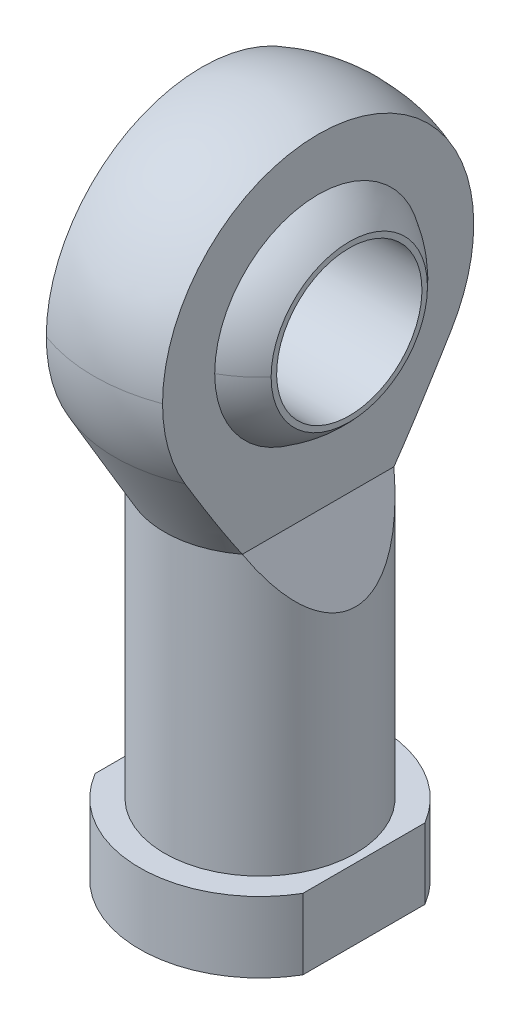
ISO-10303-21;
HEADER;
FILE_DESCRIPTION(('STEP AP214'),'2;1');
FILE_NAME('part.step','',(''),(''),'','','');
FILE_SCHEMA(('AUTOMOTIVE_DESIGN { 1 0 10303 214 1 1 1 1 }'));
ENDSEC;
DATA;
#1=APPLICATION_CONTEXT('core data for automotive mechanical design processes');
#2=APPLICATION_PROTOCOL_DEFINITION('international standard','automotive_design',2000,#1);
#3=PRODUCT_CONTEXT('',#1,'mechanical');
#4=PRODUCT('Part','Part','',(#3));
#5=PRODUCT_RELATED_PRODUCT_CATEGORY('part','',(#4));
#6=PRODUCT_DEFINITION_FORMATION('','',#4);
#7=PRODUCT_DEFINITION_CONTEXT('part definition',#1,'design');
#8=PRODUCT_DEFINITION('design','',#6,#7);
#9=PRODUCT_DEFINITION_SHAPE('','',#8);
#10=(LENGTH_UNIT() NAMED_UNIT(*) SI_UNIT(.MILLI.,.METRE.));
#11=(NAMED_UNIT(*) PLANE_ANGLE_UNIT() SI_UNIT($,.RADIAN.));
#12=(NAMED_UNIT(*) SI_UNIT($,.STERADIAN.) SOLID_ANGLE_UNIT());
#13=UNCERTAINTY_MEASURE_WITH_UNIT(LENGTH_MEASURE(1.E-05),#10,'distance_accuracy_value','');
#14=(GEOMETRIC_REPRESENTATION_CONTEXT(3) GLOBAL_UNCERTAINTY_ASSIGNED_CONTEXT((#13)) GLOBAL_UNIT_ASSIGNED_CONTEXT((#10,
#11,#12)) REPRESENTATION_CONTEXT('',''));
#15=CARTESIAN_POINT('',(0.,0.,0.));
#16=DIRECTION('',(0.,0.,1.));
#17=DIRECTION('',(1.,0.,0.));
#18=AXIS2_PLACEMENT_3D('',#15,#16,#17);
#19=CARTESIAN_POINT('',(-21.5,84.,80.));
#20=DIRECTION('',(-1.,0.,0.));
#21=DIRECTION('',(0.,-1.,0.));
#22=AXIS2_PLACEMENT_3D('',#19,#20,#21);
#23=PLANE('',#22);
#24=CARTESIAN_POINT('',(-21.5,125.,0.));
#25=DIRECTION('',(1.,0.,0.));
#26=DIRECTION('',(0.,1.,0.));
#27=AXIS2_PLACEMENT_3D('',#24,#25,#26);
#28=CIRCLE('',#27,17.5);
#29=CARTESIAN_POINT('',(-21.5,142.5,0.));
#30=VERTEX_POINT('',#29);
#31=EDGE_CURVE('E437',#30,#30,#28,.T.);
#32=ORIENTED_EDGE('',*,*,#31,.T.);
#33=EDGE_LOOP('',(#32));
#34=FACE_BOUND('',#33,.T.);
#35=CARTESIAN_POINT('',(-21.5,125.,0.));
#36=DIRECTION('',(1.,0.,0.));
#37=DIRECTION('',(0.,1.,0.));
#38=AXIS2_PLACEMENT_3D('',#35,#36,#37);
#39=CIRCLE('',#38,18.8223437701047);
#40=CARTESIAN_POINT('',(-21.5,125.,18.8223437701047));
#41=VERTEX_POINT('',#40);
#42=CARTESIAN_POINT('',(-21.5,125.,-18.8223437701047));
#43=VERTEX_POINT('',#42);
#44=EDGE_CURVE('E10',#41,#43,#39,.T.);
#45=ORIENTED_EDGE('',*,*,#44,.F.);
#46=CARTESIAN_POINT('',(-21.5,125.,0.));
#47=DIRECTION('',(1.,0.,0.));
#48=DIRECTION('',(0.,1.,0.));
#49=AXIS2_PLACEMENT_3D('',#46,#47,#48);
#50=CIRCLE('',#49,18.8223437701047);
#51=EDGE_CURVE('E981',#43,#41,#50,.T.);
#52=ORIENTED_EDGE('',*,*,#51,.F.);
#53=EDGE_LOOP('',(#45,#52));
#54=FACE_BOUND('',#53,.T.);
#55=ADVANCED_FACE('F15',(#34,#54),#23,.T.);
#56=CARTESIAN_POINT('',(21.5,166.,80.));
#57=DIRECTION('',(1.,0.,0.));
#58=DIRECTION('',(0.,0.,1.));
#59=AXIS2_PLACEMENT_3D('',#56,#57,#58);
#60=PLANE('',#59);
#61=CARTESIAN_POINT('',(21.5,125.,0.));
#62=DIRECTION('',(-1.,0.,0.));
#63=DIRECTION('',(0.,1.,0.));
#64=AXIS2_PLACEMENT_3D('',#61,#62,#63);
#65=CIRCLE('',#64,17.5);
#66=CARTESIAN_POINT('',(21.5,142.5,0.));
#67=VERTEX_POINT('',#66);
#68=EDGE_CURVE('E434',#67,#67,#65,.T.);
#69=ORIENTED_EDGE('',*,*,#68,.T.);
#70=EDGE_LOOP('',(#69));
#71=FACE_BOUND('',#70,.T.);
#72=CARTESIAN_POINT('',(21.5,125.,0.));
#73=DIRECTION('',(-1.,0.,0.));
#74=DIRECTION('',(0.,1.,0.));
#75=AXIS2_PLACEMENT_3D('',#72,#73,#74);
#76=CIRCLE('',#75,18.8223437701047);
#77=CARTESIAN_POINT('',(21.5,125.,18.8223437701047));
#78=VERTEX_POINT('',#77);
#79=CARTESIAN_POINT('',(21.5,125.,-18.8223437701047));
#80=VERTEX_POINT('',#79);
#81=EDGE_CURVE('E227',#78,#80,#76,.T.);
#82=ORIENTED_EDGE('',*,*,#81,.F.);
#83=CARTESIAN_POINT('',(21.5,125.,0.));
#84=DIRECTION('',(-1.,0.,0.));
#85=DIRECTION('',(0.,1.,0.));
#86=AXIS2_PLACEMENT_3D('',#83,#84,#85);
#87=CIRCLE('',#86,18.8223437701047);
#88=EDGE_CURVE('E26',#80,#78,#87,.T.);
#89=ORIENTED_EDGE('',*,*,#88,.F.);
#90=EDGE_LOOP('',(#82,#89));
#91=FACE_BOUND('',#90,.T.);
#92=ADVANCED_FACE('F523',(#71,#91),#60,.T.);
#93=CARTESIAN_POINT('',(29.,0.,0.));
#94=DIRECTION('',(0.,1.,0.));
#95=DIRECTION('',(0.,0.,-1.));
#96=AXIS2_PLACEMENT_3D('',#93,#94,#95);
#97=PLANE('',#96);
#98=CARTESIAN_POINT('',(0.,0.,0.));
#99=DIRECTION('',(0.,-1.,0.));
#100=DIRECTION('',(1.,0.,0.));
#101=AXIS2_PLACEMENT_3D('',#98,#99,#100);
#102=CIRCLE('',#101,18.);
#103=CARTESIAN_POINT('',(18.,0.,0.));
#104=VERTEX_POINT('',#103);
#105=EDGE_CURVE('E1013',#104,#104,#102,.T.);
#106=ORIENTED_EDGE('',*,*,#105,.F.);
#107=EDGE_LOOP('',(#106));
#108=FACE_BOUND('',#107,.T.);
#109=CARTESIAN_POINT('',(0.,0.,0.));
#110=DIRECTION('',(0.,1.,0.));
#111=DIRECTION('',(-1.,0.,0.));
#112=AXIS2_PLACEMENT_3D('',#109,#110,#111);
#113=CIRCLE('',#112,29.);
#114=CARTESIAN_POINT('',(25.,0.,-14.6969384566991));
#115=VERTEX_POINT('',#114);
#116=CARTESIAN_POINT('',(-25.,0.,-14.6969384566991));
#117=VERTEX_POINT('',#116);
#118=EDGE_CURVE('E445',#115,#117,#113,.T.);
#119=ORIENTED_EDGE('',*,*,#118,.F.);
#120=DIRECTION('',(0.,0.,-1.));
#121=VECTOR('',#120,1.);
#122=CARTESIAN_POINT('',(25.,0.,80.));
#123=LINE('',#122,#121);
#124=CARTESIAN_POINT('',(25.,0.,14.6969384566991));
#125=VERTEX_POINT('',#124);
#126=EDGE_CURVE('E441',#125,#115,#123,.T.);
#127=ORIENTED_EDGE('',*,*,#126,.F.);
#128=CARTESIAN_POINT('',(0.,0.,0.));
#129=DIRECTION('',(0.,1.,0.));
#130=DIRECTION('',(-1.,0.,0.));
#131=AXIS2_PLACEMENT_3D('',#128,#129,#130);
#132=CIRCLE('',#131,29.);
#133=CARTESIAN_POINT('',(-25.,0.,14.6969384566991));
#134=VERTEX_POINT('',#133);
#135=EDGE_CURVE('E40',#134,#125,#132,.T.);
#136=ORIENTED_EDGE('',*,*,#135,.F.);
#137=DIRECTION('',(0.,0.,1.));
#138=VECTOR('',#137,1.);
#139=CARTESIAN_POINT('',(-25.,0.,80.));
#140=LINE('',#139,#138);
#141=EDGE_CURVE('E50',#117,#134,#140,.T.);
#142=ORIENTED_EDGE('',*,*,#141,.F.);
#143=EDGE_LOOP('',(#119,#127,#136,#142));
#144=FACE_BOUND('',#143,.T.);
#145=ADVANCED_FACE('F517',(#108,#144),#97,.F.);
#146=CARTESIAN_POINT('',(-14.,125.,24.9104521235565));
#147=CARTESIAN_POINT('',(-14.,75.1790957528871,24.9104521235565));
#148=CARTESIAN_POINT('',(-14.,75.1790957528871,-24.9104521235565));
#149=CARTESIAN_POINT('',(-14.,125.,-24.9104521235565));
#150=CARTESIAN_POINT('',(-16.8342365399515,125.,23.3175741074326));
#151=CARTESIAN_POINT('',(-16.8342365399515,78.364851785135,23.3175741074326));
#152=CARTESIAN_POINT('',(-16.8342365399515,78.364851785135,-23.3175741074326));
#153=CARTESIAN_POINT('',(-16.8342365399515,125.,-23.3175741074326));
#154=CARTESIAN_POINT('',(-19.3584501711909,125.,21.2685492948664));
#155=CARTESIAN_POINT('',(-19.358450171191,82.4629014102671,21.2685492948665));
#156=CARTESIAN_POINT('',(-19.358450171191,82.4629014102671,-21.2685492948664));
#157=CARTESIAN_POINT('',(-19.3584501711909,125.,-21.2685492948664));
#158=CARTESIAN_POINT('',(-21.5,125.,18.8223437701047));
#159=CARTESIAN_POINT('',(-21.5,87.3553124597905,18.8223437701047));
#160=CARTESIAN_POINT('',(-21.5,87.3553124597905,-18.8223437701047));
#161=CARTESIAN_POINT('',(-21.5,125.,-18.8223437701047));
#162=(BOUNDED_SURFACE() B_SPLINE_SURFACE(3,3,((#146,#147,#148,#149),(#150,#151,#152,#153),(#154,
#155,#156,#157),(#158,#159,#160,#161)),.UNSPECIFIED.,.F.,.F.,
.F.) B_SPLINE_SURFACE_WITH_KNOTS((4,4),(4,4),(0.,1.),(0.,1.),
.UNSPECIFIED.) GEOMETRIC_REPRESENTATION_ITEM() RATIONAL_B_SPLINE_SURFACE(((1.,0.333333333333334,
0.333333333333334,1.),(0.990407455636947,0.330135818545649,0.330135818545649,0.990407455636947),
(0.990407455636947,0.330135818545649,0.330135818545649,0.990407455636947),(1.,0.333333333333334,
0.333333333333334,1.))) REPRESENTATION_ITEM('') SURFACE());
#163=CARTESIAN_POINT('',(0.,125.,0.));
#164=DIRECTION('',(0.,1.,0.));
#165=DIRECTION('',(1.,0.,0.));
#166=AXIS2_PLACEMENT_3D('',#163,#164,#165);
#167=CIRCLE('',#166,28.575);
#168=CARTESIAN_POINT('',(-14.,125.,-24.9104521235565));
#169=VERTEX_POINT('',#168);
#170=EDGE_CURVE('E1001',#169,#43,#167,.T.);
#171=CARTESIAN_POINT('',(-14.,125.,0.));
#172=DIRECTION('',(1.,0.,0.));
#173=DIRECTION('',(0.,1.,0.));
#174=AXIS2_PLACEMENT_3D('',#171,#172,#173);
#175=CIRCLE('',#174,24.9104521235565);
#176=CARTESIAN_POINT('',(-14.,125.,24.9104521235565));
#177=VERTEX_POINT('',#176);
#178=EDGE_CURVE('E415',#177,#169,#175,.T.);
#179=CARTESIAN_POINT('',(0.,125.,0.));
#180=DIRECTION('',(0.,-1.,0.));
#181=DIRECTION('',(1.,0.,0.));
#182=AXIS2_PLACEMENT_3D('',#179,#180,#181);
#183=CIRCLE('',#182,28.575);
#184=EDGE_CURVE('E385',#177,#41,#183,.T.);
#185=ORIENTED_EDGE('',*,*,#170,.F.);
#186=ORIENTED_EDGE('',*,*,#178,.F.);
#187=ORIENTED_EDGE('',*,*,#184,.T.);
#188=ORIENTED_EDGE('',*,*,#44,.T.);
#189=EDGE_LOOP('',(#185,#186,#187,#188));
#190=FACE_BOUND('',#189,.T.);
#191=ADVANCED_FACE('F522',(#190),#162,.T.);
#192=CARTESIAN_POINT('',(21.5,125.,18.8223437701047));
#193=CARTESIAN_POINT('',(21.5,87.3553124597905,18.8223437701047));
#194=CARTESIAN_POINT('',(21.5,87.3553124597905,-18.8223437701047));
#195=CARTESIAN_POINT('',(21.5,125.,-18.8223437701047));
#196=CARTESIAN_POINT('',(19.3584501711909,125.,21.2685492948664));
#197=CARTESIAN_POINT('',(19.358450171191,82.4629014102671,21.2685492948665));
#198=CARTESIAN_POINT('',(19.358450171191,82.4629014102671,-21.2685492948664));
#199=CARTESIAN_POINT('',(19.3584501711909,125.,-21.2685492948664));
#200=CARTESIAN_POINT('',(16.8342365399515,125.,23.3175741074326));
#201=CARTESIAN_POINT('',(16.8342365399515,78.364851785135,23.3175741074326));
#202=CARTESIAN_POINT('',(16.8342365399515,78.364851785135,-23.3175741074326));
#203=CARTESIAN_POINT('',(16.8342365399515,125.,-23.3175741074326));
#204=CARTESIAN_POINT('',(14.,125.,24.9104521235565));
#205=CARTESIAN_POINT('',(14.,75.1790957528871,24.9104521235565));
#206=CARTESIAN_POINT('',(14.,75.1790957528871,-24.9104521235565));
#207=CARTESIAN_POINT('',(14.,125.,-24.9104521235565));
#208=(BOUNDED_SURFACE() B_SPLINE_SURFACE(3,3,((#192,#193,#194,#195),(#196,#197,#198,#199),(#200,
#201,#202,#203),(#204,#205,#206,#207)),.UNSPECIFIED.,.F.,.F.,
.F.) B_SPLINE_SURFACE_WITH_KNOTS((4,4),(4,4),(0.,1.),(0.,1.),
.UNSPECIFIED.) GEOMETRIC_REPRESENTATION_ITEM() RATIONAL_B_SPLINE_SURFACE(((1.,0.333333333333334,
0.333333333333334,1.),(0.990407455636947,0.330135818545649,0.330135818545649,0.990407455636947),
(0.990407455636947,0.330135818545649,0.330135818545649,0.990407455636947),(1.,0.333333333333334,
0.333333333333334,1.))) REPRESENTATION_ITEM('') SURFACE());
#209=CARTESIAN_POINT('',(0.,125.,0.));
#210=DIRECTION('',(0.,1.,0.));
#211=DIRECTION('',(1.,0.,0.));
#212=AXIS2_PLACEMENT_3D('',#209,#210,#211);
#213=CIRCLE('',#212,28.575);
#214=CARTESIAN_POINT('',(14.,125.,-24.9104521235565));
#215=VERTEX_POINT('',#214);
#216=EDGE_CURVE('E990',#80,#215,#213,.T.);
#217=CARTESIAN_POINT('',(0.,125.,0.));
#218=DIRECTION('',(0.,-1.,0.));
#219=DIRECTION('',(1.,0.,0.));
#220=AXIS2_PLACEMENT_3D('',#217,#218,#219);
#221=CIRCLE('',#220,28.575);
#222=CARTESIAN_POINT('',(14.,125.,24.9104521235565));
#223=VERTEX_POINT('',#222);
#224=EDGE_CURVE('E989',#78,#223,#221,.T.);
#225=CARTESIAN_POINT('',(14.,125.,0.));
#226=DIRECTION('',(-1.,0.,0.));
#227=DIRECTION('',(0.,1.,0.));
#228=AXIS2_PLACEMENT_3D('',#225,#226,#227);
#229=CIRCLE('',#228,24.9104521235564);
#230=EDGE_CURVE('E412',#215,#223,#229,.T.);
#231=ORIENTED_EDGE('',*,*,#216,.F.);
#232=ORIENTED_EDGE('',*,*,#88,.T.);
#233=ORIENTED_EDGE('',*,*,#224,.T.);
#234=ORIENTED_EDGE('',*,*,#230,.F.);
#235=EDGE_LOOP('',(#231,#232,#233,#234));
#236=FACE_BOUND('',#235,.T.);
#237=ADVANCED_FACE('F509',(#236),#208,.T.);
#238=CARTESIAN_POINT('',(0.,0.,0.));
#239=DIRECTION('',(0.,1.,0.));
#240=DIRECTION('',(-1.,0.,0.));
#241=AXIS2_PLACEMENT_3D('',#238,#239,#240);
#242=CYLINDRICAL_SURFACE('',#241,29.);
#243=DIRECTION('',(0.,-1.,0.));
#244=VECTOR('',#243,1.);
#245=CARTESIAN_POINT('',(25.,64.9474411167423,14.6969384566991));
#246=LINE('',#245,#244);
#247=CARTESIAN_POINT('',(25.,17.,14.6969384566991));
#248=VERTEX_POINT('',#247);
#249=EDGE_CURVE('E446',#248,#125,#246,.T.);
#250=ORIENTED_EDGE('',*,*,#249,.F.);
#251=CARTESIAN_POINT('',(0.,17.,0.));
#252=DIRECTION('',(0.,-1.,0.));
#253=DIRECTION('',(-1.,0.,0.));
#254=AXIS2_PLACEMENT_3D('',#251,#252,#253);
#255=CIRCLE('',#254,29.);
#256=CARTESIAN_POINT('',(-25.,17.,14.6969384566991));
#257=VERTEX_POINT('',#256);
#258=EDGE_CURVE('E427',#248,#257,#255,.T.);
#259=ORIENTED_EDGE('',*,*,#258,.T.);
#260=DIRECTION('',(0.,1.,0.));
#261=VECTOR('',#260,1.);
#262=CARTESIAN_POINT('',(-25.,0.,14.6969384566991));
#263=LINE('',#262,#261);
#264=EDGE_CURVE('E996',#134,#257,#263,.T.);
#265=ORIENTED_EDGE('',*,*,#264,.F.);
#266=ORIENTED_EDGE('',*,*,#135,.T.);
#267=EDGE_LOOP('',(#250,#259,#265,#266));
#268=FACE_BOUND('',#267,.T.);
#269=ADVANCED_FACE('F282',(#268),#242,.T.);
#270=CARTESIAN_POINT('',(-25.,0.,80.));
#271=DIRECTION('',(-1.,0.,0.));
#272=DIRECTION('',(0.,-1.,0.));
#273=AXIS2_PLACEMENT_3D('',#270,#271,#272);
#274=PLANE('',#273);
#275=ORIENTED_EDGE('',*,*,#264,.T.);
#276=DIRECTION('',(0.,0.,-1.));
#277=VECTOR('',#276,1.);
#278=CARTESIAN_POINT('',(-25.,17.,0.));
#279=LINE('',#278,#277);
#280=CARTESIAN_POINT('',(-25.,17.,-14.6969384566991));
#281=VERTEX_POINT('',#280);
#282=EDGE_CURVE('E397',#257,#281,#279,.T.);
#283=ORIENTED_EDGE('',*,*,#282,.T.);
#284=DIRECTION('',(0.,1.,0.));
#285=VECTOR('',#284,1.);
#286=CARTESIAN_POINT('',(-25.,0.,-14.6969384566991));
#287=LINE('',#286,#285);
#288=EDGE_CURVE('E108',#117,#281,#287,.T.);
#289=ORIENTED_EDGE('',*,*,#288,.F.);
#290=ORIENTED_EDGE('',*,*,#141,.T.);
#291=EDGE_LOOP('',(#275,#283,#289,#290));
#292=FACE_BOUND('',#291,.T.);
#293=ADVANCED_FACE('F280',(#292),#274,.T.);
#294=CARTESIAN_POINT('',(0.,0.,0.));
#295=DIRECTION('',(0.,1.,0.));
#296=DIRECTION('',(-1.,0.,0.));
#297=AXIS2_PLACEMENT_3D('',#294,#295,#296);
#298=CYLINDRICAL_SURFACE('',#297,29.);
#299=DIRECTION('',(0.,1.,0.));
#300=VECTOR('',#299,1.);
#301=CARTESIAN_POINT('',(25.,64.9474411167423,-14.6969384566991));
#302=LINE('',#301,#300);
#303=CARTESIAN_POINT('',(25.,17.,-14.6969384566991));
#304=VERTEX_POINT('',#303);
#305=EDGE_CURVE('E1006',#115,#304,#302,.T.);
#306=ORIENTED_EDGE('',*,*,#305,.F.);
#307=ORIENTED_EDGE('',*,*,#118,.T.);
#308=ORIENTED_EDGE('',*,*,#288,.T.);
#309=CARTESIAN_POINT('',(0.,17.,0.));
#310=DIRECTION('',(0.,-1.,0.));
#311=DIRECTION('',(-1.,0.,0.));
#312=AXIS2_PLACEMENT_3D('',#309,#310,#311);
#313=CIRCLE('',#312,29.);
#314=EDGE_CURVE('E394',#281,#304,#313,.T.);
#315=ORIENTED_EDGE('',*,*,#314,.T.);
#316=EDGE_LOOP('',(#306,#307,#308,#315));
#317=FACE_BOUND('',#316,.T.);
#318=ADVANCED_FACE('F487',(#317),#298,.T.);
#319=CARTESIAN_POINT('',(25.,64.9474411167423,80.));
#320=DIRECTION('',(1.,0.,0.));
#321=DIRECTION('',(0.,0.,1.));
#322=AXIS2_PLACEMENT_3D('',#319,#320,#321);
#323=PLANE('',#322);
#324=ORIENTED_EDGE('',*,*,#305,.T.);
#325=DIRECTION('',(0.,0.,1.));
#326=VECTOR('',#325,1.);
#327=CARTESIAN_POINT('',(25.,17.,0.));
#328=LINE('',#327,#326);
#329=EDGE_CURVE('E317',#304,#248,#328,.T.);
#330=ORIENTED_EDGE('',*,*,#329,.T.);
#331=ORIENTED_EDGE('',*,*,#249,.T.);
#332=ORIENTED_EDGE('',*,*,#126,.T.);
#333=EDGE_LOOP('',(#324,#330,#331,#332));
#334=FACE_BOUND('',#333,.T.);
#335=ADVANCED_FACE('F548',(#334),#323,.T.);
#336=CARTESIAN_POINT('',(-14.,84.,80.));
#337=DIRECTION('',(-1.,0.,0.));
#338=DIRECTION('',(0.,-1.,0.));
#339=AXIS2_PLACEMENT_3D('',#336,#337,#338);
#340=PLANE('',#339);
#341=ORIENTED_EDGE('',*,*,#178,.T.);
#342=CARTESIAN_POINT('',(-14.,125.,0.));
#343=DIRECTION('',(1.,0.,0.));
#344=DIRECTION('',(0.,1.,0.));
#345=AXIS2_PLACEMENT_3D('',#342,#343,#344);
#346=CIRCLE('',#345,24.9104521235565);
#347=EDGE_CURVE('E1000',#169,#177,#346,.T.);
#348=ORIENTED_EDGE('',*,*,#347,.T.);
#349=EDGE_LOOP('',(#341,#348));
#350=FACE_BOUND('',#349,.T.);
#351=CARTESIAN_POINT('',(-13.9999999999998,105.598336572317,32.0558178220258));
#352=CARTESIAN_POINT('',(-14.0000041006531,104.936056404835,31.6549662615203));
#353=CARTESIAN_POINT('',(-14.0000521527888,104.274311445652,31.2532289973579));
#354=CARTESIAN_POINT('',(-14.0001684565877,102.973211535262,30.4606843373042));
#355=CARTESIAN_POINT('',(-14.0002360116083,102.333818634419,30.0699392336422));
#356=CARTESIAN_POINT('',(-14.000330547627,101.077420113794,29.2993776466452));
#357=CARTESIAN_POINT('',(-14.0003587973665,100.46037386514,28.9196274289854));
#358=CARTESIAN_POINT('',(-14.0003584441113,99.2486731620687,28.171035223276));
#359=CARTESIAN_POINT('',(-14.0003317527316,98.6539747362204,27.8022644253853));
#360=CARTESIAN_POINT('',(-14.000235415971,97.486971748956,27.0756045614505));
#361=CARTESIAN_POINT('',(-14.0001673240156,96.9146194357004,26.7177922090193));
#362=CARTESIAN_POINT('',(-14.0000555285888,95.7923161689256,26.0130032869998));
#363=CARTESIAN_POINT('',(-14.0000110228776,95.2423128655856,25.666110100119));
#364=CARTESIAN_POINT('',(-13.9999874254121,94.0665228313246,24.9208993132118));
#365=CARTESIAN_POINT('',(-14.0000184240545,93.44096718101,24.5222168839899));
#366=CARTESIAN_POINT('',(-14.0000473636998,92.2171482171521,23.7373577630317));
#367=CARTESIAN_POINT('',(-14.000046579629,91.6187957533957,23.351320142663));
#368=CARTESIAN_POINT('',(-14.0000210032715,90.4493934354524,22.5916820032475));
#369=CARTESIAN_POINT('',(-13.9999972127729,89.8782448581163,22.2182335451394));
#370=CARTESIAN_POINT('',(-14.0000030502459,88.684772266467,21.4319616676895));
#371=CARTESIAN_POINT('',(-14.000037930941,88.0627050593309,21.018748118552));
#372=CARTESIAN_POINT('',(-14.0000682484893,86.8508682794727,20.2060851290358));
#373=CARTESIAN_POINT('',(-14.000065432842,86.2609340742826,19.8068815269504));
#374=CARTESIAN_POINT('',(-14.0000416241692,85.1134253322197,19.0220388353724));
#375=CARTESIAN_POINT('',(-14.0000215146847,84.5556627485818,18.6366745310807));
#376=CARTESIAN_POINT('',(-14.0000000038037,83.9999999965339,18.2482876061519));
#377=B_SPLINE_CURVE_WITH_KNOTS('',3,(#351,#352,#353,#354,#355,#356,#357,#358,#359,#360,#361,
#362,#363,#364,#365,#366,#367,#368,#369,#370,#371,#372,#373,#374,#375,#376),.UNSPECIFIED.,.F.,
.F.,(4,2,2,2,2,2,2,2,2,2,2,2,4),(0.,2.32242863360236,4.57043455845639,6.74404672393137,
8.84330973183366,10.8682866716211,12.8190623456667,15.0444522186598,17.1806650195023,
19.2278614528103,21.4682430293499,23.6051409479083,25.6389419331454),.UNSPECIFIED.);
#378=CARTESIAN_POINT('',(-14.,105.598336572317,32.0558178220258));
#379=VERTEX_POINT('',#378);
#380=CARTESIAN_POINT('',(-14.,84.,18.2482876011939));
#381=VERTEX_POINT('',#380);
#382=EDGE_CURVE('E202',#379,#381,#377,.T.);
#383=ORIENTED_EDGE('',*,*,#382,.F.);
#384=CARTESIAN_POINT('',(-14.,125.,0.));
#385=DIRECTION('',(1.,0.,0.));
#386=DIRECTION('',(0.,1.,0.));
#387=AXIS2_PLACEMENT_3D('',#384,#385,#386);
#388=CIRCLE('',#387,37.4699879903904);
#389=CARTESIAN_POINT('',(-14.,125.,37.4699879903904));
#390=VERTEX_POINT('',#389);
#391=EDGE_CURVE('E207',#390,#379,#388,.T.);
#392=ORIENTED_EDGE('',*,*,#391,.F.);
#393=CARTESIAN_POINT('',(-14.,125.,0.));
#394=DIRECTION('',(1.,0.,0.));
#395=DIRECTION('',(0.,1.,0.));
#396=AXIS2_PLACEMENT_3D('',#393,#394,#395);
#397=CIRCLE('',#396,37.4699879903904);
#398=CARTESIAN_POINT('',(-14.,125.,-37.4699879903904));
#399=VERTEX_POINT('',#398);
#400=EDGE_CURVE('E408',#399,#390,#397,.T.);
#401=ORIENTED_EDGE('',*,*,#400,.F.);
#402=CARTESIAN_POINT('',(-14.,125.,0.));
#403=DIRECTION('',(1.,0.,0.));
#404=DIRECTION('',(0.,1.,0.));
#405=AXIS2_PLACEMENT_3D('',#402,#403,#404);
#406=CIRCLE('',#405,37.4699879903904);
#407=CARTESIAN_POINT('',(-14.,105.598336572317,-32.0558178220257));
#408=VERTEX_POINT('',#407);
#409=EDGE_CURVE('E123',#408,#399,#406,.T.);
#410=ORIENTED_EDGE('',*,*,#409,.F.);
#411=CARTESIAN_POINT('',(-14.0000000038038,83.9999999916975,-18.2482876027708));
#412=CARTESIAN_POINT('',(-14.0000214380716,84.5556566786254,-18.6366703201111));
#413=CARTESIAN_POINT('',(-14.0000418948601,85.1134132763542,-19.0220302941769));
#414=CARTESIAN_POINT('',(-14.000066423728,86.2609160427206,-19.8068685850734));
#415=CARTESIAN_POINT('',(-14.0000696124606,86.850850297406,-20.206072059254));
#416=CARTESIAN_POINT('',(-14.0000390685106,88.0626930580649,-21.0187393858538));
#417=CARTESIAN_POINT('',(-14.0000035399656,88.6847662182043,-21.4319573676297));
#418=CARTESIAN_POINT('',(-13.9999967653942,89.8782304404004,-22.2182243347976));
#419=CARTESIAN_POINT('',(-14.0000202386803,90.4493645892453,-22.5916636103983));
#420=CARTESIAN_POINT('',(-14.0000461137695,91.6187524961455,-23.3512924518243));
#421=CARTESIAN_POINT('',(-14.000047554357,92.2171050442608,-23.7373298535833));
#422=CARTESIAN_POINT('',(-14.0000190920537,93.4409384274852,-24.5221981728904));
#423=CARTESIAN_POINT('',(-13.9999878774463,94.066508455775,-24.9208899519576));
#424=CARTESIAN_POINT('',(-14.0000106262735,95.2423073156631,-25.666106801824));
#425=CARTESIAN_POINT('',(-14.0000545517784,95.7923050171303,-26.0129967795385));
#426=CARTESIAN_POINT('',(-14.000165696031,96.9145993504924,-26.7177804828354));
#427=CARTESIAN_POINT('',(-14.000233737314,97.4869483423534,-27.0755908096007));
#428=CARTESIAN_POINT('',(-14.0003301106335,98.6539468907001,-27.8022479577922));
#429=CARTESIAN_POINT('',(-14.0003568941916,99.2486442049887,-28.1710180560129));
#430=CARTESIAN_POINT('',(-14.0003575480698,100.460344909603,-28.9196101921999));
#431=CARTESIAN_POINT('',(-14.0003295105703,101.077392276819,-29.2993610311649));
#432=CARTESIAN_POINT('',(-14.0002353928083,102.33379525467,-30.0699252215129));
#433=CARTESIAN_POINT('',(-14.000168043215,102.973191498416,-30.4606723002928));
#434=CARTESIAN_POINT('',(-14.0000520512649,104.274300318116,-31.2532222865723));
#435=CARTESIAN_POINT('',(-14.0000041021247,104.936050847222,-31.6549628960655));
#436=CARTESIAN_POINT('',(-14.,105.598336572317,-32.0558178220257));
#437=B_SPLINE_CURVE_WITH_KNOTS('',3,(#411,#412,#413,#414,#415,#416,#417,#418,#419,#420,#421,
#422,#423,#424,#425,#426,#427,#428,#429,#430,#431,#432,#433,#434,#435,#436),.UNSPECIFIED.,.F.,
.F.,(4,2,2,2,2,2,2,2,2,2,2,2,4),(0.,2.03377883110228,4.17067665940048,6.41108047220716,
8.45822559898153,10.5944382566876,12.8198795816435,14.7706359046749,16.7956011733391,
18.8948602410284,21.0684762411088,23.3164938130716,25.63894193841),.UNSPECIFIED.);
#438=CARTESIAN_POINT('',(-14.,83.9999999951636,-18.2482875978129));
#439=VERTEX_POINT('',#438);
#440=EDGE_CURVE('E387',#439,#408,#437,.T.);
#441=ORIENTED_EDGE('',*,*,#440,.F.);
#442=DIRECTION('',(0.,0.,-1.));
#443=VECTOR('',#442,1.);
#444=CARTESIAN_POINT('',(-14.,84.,80.));
#445=LINE('',#444,#443);
#446=EDGE_CURVE('E209',#381,#439,#445,.T.);
#447=ORIENTED_EDGE('',*,*,#446,.F.);
#448=EDGE_LOOP('',(#383,#392,#401,#410,#441,#447));
#449=FACE_BOUND('',#448,.T.);
#450=ADVANCED_FACE('F205',(#350,#449),#340,.T.);
#451=CARTESIAN_POINT('',(14.,166.,80.));
#452=DIRECTION('',(1.,0.,0.));
#453=DIRECTION('',(0.,0.,1.));
#454=AXIS2_PLACEMENT_3D('',#451,#452,#453);
#455=PLANE('',#454);
#456=CARTESIAN_POINT('',(14.,125.,0.));
#457=DIRECTION('',(-1.,0.,0.));
#458=DIRECTION('',(0.,1.,0.));
#459=AXIS2_PLACEMENT_3D('',#456,#457,#458);
#460=CIRCLE('',#459,24.9104521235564);
#461=EDGE_CURVE('E985',#223,#215,#460,.T.);
#462=ORIENTED_EDGE('',*,*,#461,.T.);
#463=ORIENTED_EDGE('',*,*,#230,.T.);
#464=EDGE_LOOP('',(#462,#463));
#465=FACE_BOUND('',#464,.T.);
#466=CARTESIAN_POINT('',(14.,105.598336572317,-32.0558178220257));
#467=CARTESIAN_POINT('',(14.0000041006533,104.936056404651,-31.654966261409));
#468=CARTESIAN_POINT('',(14.0000521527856,104.274311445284,-31.2532289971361));
#469=CARTESIAN_POINT('',(14.0001684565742,102.9732115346,-30.4606843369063));
#470=CARTESIAN_POINT('',(14.000236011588,102.333818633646,-30.069939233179));
#471=CARTESIAN_POINT('',(14.0003305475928,101.077420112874,-29.299377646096));
#472=CARTESIAN_POINT('',(14.0003587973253,100.460373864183,-28.9196274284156));
#473=CARTESIAN_POINT('',(14.0003584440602,99.2486731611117,-28.1710352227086));
#474=CARTESIAN_POINT('',(14.0003317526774,98.6539747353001,-27.8022644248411));
#475=CARTESIAN_POINT('',(14.0002354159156,97.4869717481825,-27.075604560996));
#476=CARTESIAN_POINT('',(14.0001673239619,96.9146194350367,-26.7177922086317));
#477=CARTESIAN_POINT('',(14.0000555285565,95.7923161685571,-26.0130032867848));
#478=CARTESIAN_POINT('',(14.0000110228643,95.2423128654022,-25.6661101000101));
#479=CARTESIAN_POINT('',(13.9999874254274,94.0665228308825,-24.9208993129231));
#480=CARTESIAN_POINT('',(14.0000184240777,93.4409671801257,-24.5222168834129));
#481=CARTESIAN_POINT('',(14.0000473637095,92.2171482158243,-23.737357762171));
#482=CARTESIAN_POINT('',(14.0000465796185,91.6187957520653,-23.351320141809));
#483=CARTESIAN_POINT('',(14.0000210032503,90.4493934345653,-22.5916820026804));
#484=CARTESIAN_POINT('',(13.9999972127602,89.878244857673,-22.2182335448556));
#485=CARTESIAN_POINT('',(14.0000030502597,88.6847722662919,-21.4319616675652));
#486=CARTESIAN_POINT('',(14.0000379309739,88.0627050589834,-21.0187481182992));
#487=CARTESIAN_POINT('',(14.000068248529,86.8508682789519,-20.2060851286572));
#488=CARTESIAN_POINT('',(14.0000654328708,86.2609340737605,-19.8068815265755));
#489=CARTESIAN_POINT('',(14.0000416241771,85.1134253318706,-19.022038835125));
#490=CARTESIAN_POINT('',(14.0000215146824,84.5556627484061,-18.6366745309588));
#491=CARTESIAN_POINT('',(14.0000000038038,83.9999999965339,-18.2482876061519));
#492=B_SPLINE_CURVE_WITH_KNOTS('',3,(#466,#467,#468,#469,#470,#471,#472,#473,#474,#475,#476,
#477,#478,#479,#480,#481,#482,#483,#484,#485,#486,#487,#488,#489,#490,#491),.UNSPECIFIED.,.F.,
.F.,(4,2,2,2,2,2,2,2,2,2,2,2,4),(0.,2.32242863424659,4.57043455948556,6.74404672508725,
8.84330973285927,10.8682866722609,12.8190623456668,15.0444522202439,17.1806650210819,
19.2278614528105,21.4682430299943,23.60514094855,25.6389419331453),.UNSPECIFIED.);
#493=CARTESIAN_POINT('',(14.,105.598336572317,-32.0558178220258));
#494=VERTEX_POINT('',#493);
#495=CARTESIAN_POINT('',(14.,84.,-18.248287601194));
#496=VERTEX_POINT('',#495);
#497=EDGE_CURVE('E310',#494,#496,#492,.T.);
#498=ORIENTED_EDGE('',*,*,#497,.F.);
#499=CARTESIAN_POINT('',(14.,125.,0.));
#500=DIRECTION('',(-1.,0.,0.));
#501=DIRECTION('',(0.,1.,0.));
#502=AXIS2_PLACEMENT_3D('',#499,#500,#501);
#503=CIRCLE('',#502,37.4699879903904);
#504=CARTESIAN_POINT('',(14.,125.,-37.4699879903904));
#505=VERTEX_POINT('',#504);
#506=EDGE_CURVE('E314',#505,#494,#503,.T.);
#507=ORIENTED_EDGE('',*,*,#506,.F.);
#508=CARTESIAN_POINT('',(14.,125.,0.));
#509=DIRECTION('',(-1.,0.,0.));
#510=DIRECTION('',(0.,1.,0.));
#511=AXIS2_PLACEMENT_3D('',#508,#509,#510);
#512=CIRCLE('',#511,37.4699879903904);
#513=CARTESIAN_POINT('',(14.,125.,37.4699879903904));
#514=VERTEX_POINT('',#513);
#515=EDGE_CURVE('E419',#514,#505,#512,.T.);
#516=ORIENTED_EDGE('',*,*,#515,.F.);
#517=CARTESIAN_POINT('',(14.,125.,0.));
#518=DIRECTION('',(-1.,0.,0.));
#519=DIRECTION('',(0.,1.,0.));
#520=AXIS2_PLACEMENT_3D('',#517,#518,#519);
#521=CIRCLE('',#520,37.4699879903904);
#522=CARTESIAN_POINT('',(14.,105.598336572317,32.0558178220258));
#523=VERTEX_POINT('',#522);
#524=EDGE_CURVE('E234',#523,#514,#521,.T.);
#525=ORIENTED_EDGE('',*,*,#524,.F.);
#526=CARTESIAN_POINT('',(14.0000000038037,83.9999999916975,18.2482876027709));
#527=CARTESIAN_POINT('',(14.0000214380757,84.5556566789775,18.6366703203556));
#528=CARTESIAN_POINT('',(14.0000418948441,85.1134132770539,19.0220302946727));
#529=CARTESIAN_POINT('',(14.0000664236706,86.2609160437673,19.8068685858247));
#530=CARTESIAN_POINT('',(14.0000696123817,86.8508502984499,20.2060720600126));
#531=CARTESIAN_POINT('',(14.0000390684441,88.0626930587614,21.0187393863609));
#532=CARTESIAN_POINT('',(14.0000035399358,88.6847662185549,21.4319573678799));
#533=CARTESIAN_POINT('',(13.9999967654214,89.8782304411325,22.2182243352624));
#534=CARTESIAN_POINT('',(14.000020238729,90.4493645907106,22.5916636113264));
#535=CARTESIAN_POINT('',(14.0000461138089,91.6187524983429,23.3512924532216));
#536=CARTESIAN_POINT('',(14.0000475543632,92.217105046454,23.7373298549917));
#537=CARTESIAN_POINT('',(14.0000190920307,93.4409384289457,24.5221981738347));
#538=CARTESIAN_POINT('',(13.9999878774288,94.0665084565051,24.92088995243));
#539=CARTESIAN_POINT('',(14.0000106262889,95.2423073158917,25.6661068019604));
#540=CARTESIAN_POINT('',(14.0000545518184,95.7923050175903,26.012996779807));
#541=CARTESIAN_POINT('',(14.0001656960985,96.914599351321,26.7177804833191));
#542=CARTESIAN_POINT('',(14.0002337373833,97.486948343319,27.075590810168));
#543=CARTESIAN_POINT('',(14.0003301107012,98.6539468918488,27.8022479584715));
#544=CARTESIAN_POINT('',(14.0003568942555,99.2486442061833,28.1710180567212));
#545=CARTESIAN_POINT('',(14.0003575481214,100.460344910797,28.919610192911));
#546=CARTESIAN_POINT('',(14.0003295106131,101.077392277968,29.2993610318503));
#547=CARTESIAN_POINT('',(14.0002353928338,102.333795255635,30.069925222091));
#548=CARTESIAN_POINT('',(14.000168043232,102.973191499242,30.4606723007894));
#549=CARTESIAN_POINT('',(14.0000520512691,104.274300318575,31.2532222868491));
#550=CARTESIAN_POINT('',(14.0000041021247,104.936050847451,31.6549628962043));
#551=CARTESIAN_POINT('',(14.,105.598336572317,32.0558178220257));
#552=B_SPLINE_CURVE_WITH_KNOTS('',3,(#526,#527,#528,#529,#530,#531,#532,#533,#534,#535,#536,
#537,#538,#539,#540,#541,#542,#543,#544,#545,#546,#547,#548,#549,#550,#551),.UNSPECIFIED.,.F.,
.F.,(4,2,2,2,2,2,2,2,2,2,2,2,4),(0.,2.03377883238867,4.17067666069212,6.41108047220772,
8.45822560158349,10.5944382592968,12.819879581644,14.7706359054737,16.7956011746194,
18.8948602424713,21.0684762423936,23.3164938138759,25.6389419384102),.UNSPECIFIED.);
#553=CARTESIAN_POINT('',(14.,83.9999999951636,18.2482875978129));
#554=VERTEX_POINT('',#553);
#555=EDGE_CURVE('E216',#554,#523,#552,.T.);
#556=ORIENTED_EDGE('',*,*,#555,.F.);
#557=DIRECTION('',(0.,0.,1.));
#558=VECTOR('',#557,1.);
#559=CARTESIAN_POINT('',(14.,84.,80.));
#560=LINE('',#559,#558);
#561=EDGE_CURVE('E307',#496,#554,#560,.T.);
#562=ORIENTED_EDGE('',*,*,#561,.F.);
#563=EDGE_LOOP('',(#498,#507,#516,#525,#556,#562));
#564=FACE_BOUND('',#563,.T.);
#565=ADVANCED_FACE('F324',(#465,#564),#455,.T.);
#566=CARTESIAN_POINT('',(14.,105.577655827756,-32.0432917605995));
#567=CARTESIAN_POINT('',(14.,111.471477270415,-35.6157034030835));
#568=CARTESIAN_POINT('',(14.,118.10887551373,-37.4699879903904));
#569=CARTESIAN_POINT('',(14.,125.,-37.4699879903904));
#570=CARTESIAN_POINT('',(4.87210820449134,103.809856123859,-34.9598357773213));
#571=CARTESIAN_POINT('',(4.87210820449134,110.240126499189,-38.857404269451));
#572=CARTESIAN_POINT('',(4.87210820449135,117.481653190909,-40.8804637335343));
#573=CARTESIAN_POINT('',(4.87210820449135,125.,-40.8804637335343));
#574=CARTESIAN_POINT('',(-4.87210820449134,103.809856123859,-34.9598357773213));
#575=CARTESIAN_POINT('',(-4.87210820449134,110.240126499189,-38.857404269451));
#576=CARTESIAN_POINT('',(-4.87210820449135,117.481653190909,-40.8804637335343));
#577=CARTESIAN_POINT('',(-4.87210820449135,125.,-40.8804637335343));
#578=CARTESIAN_POINT('',(-14.,105.577655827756,-32.0432917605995));
#579=CARTESIAN_POINT('',(-14.,111.471477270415,-35.6157034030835));
#580=CARTESIAN_POINT('',(-14.,118.10887551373,-37.4699879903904));
#581=CARTESIAN_POINT('',(-14.,125.,-37.4699879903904));
#582=(BOUNDED_SURFACE() B_SPLINE_SURFACE(3,3,((#566,#567,#568,#569),(#570,#571,#572,#573),(#574,
#575,#576,#577),(#578,#579,#580,#581)),.UNSPECIFIED.,.F.,.F.,
.F.) B_SPLINE_SURFACE_WITH_KNOTS((4,4),(4,4),(0.,1.),(0.00484513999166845,1.),
.UNSPECIFIED.) GEOMETRIC_REPRESENTATION_ITEM() RATIONAL_B_SPLINE_SURFACE(((0.999640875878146,
0.975173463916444,0.975293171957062,1.),(0.957489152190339,0.934053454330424,0.934168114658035,
0.957833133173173),(0.957489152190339,0.934053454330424,0.934168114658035,0.957833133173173),
(0.999640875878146,0.975173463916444,0.975293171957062,1.))) REPRESENTATION_ITEM('') SURFACE());
#583=CARTESIAN_POINT('',(0.,125.,0.));
#584=DIRECTION('',(0.,1.,0.));
#585=DIRECTION('',(1.,0.,0.));
#586=AXIS2_PLACEMENT_3D('',#583,#584,#585);
#587=CIRCLE('',#586,40.);
#588=EDGE_CURVE('E423',#505,#399,#587,.T.);
#589=CARTESIAN_POINT('',(0.,105.598336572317,0.));
#590=DIRECTION('',(0.,-1.,0.));
#591=DIRECTION('',(0.,0.,1.));
#592=AXIS2_PLACEMENT_3D('',#589,#590,#591);
#593=CIRCLE('',#592,34.9796434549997);
#594=EDGE_CURVE('E391',#408,#494,#593,.T.);
#595=ORIENTED_EDGE('',*,*,#588,.F.);
#596=ORIENTED_EDGE('',*,*,#506,.T.);
#597=ORIENTED_EDGE('',*,*,#594,.F.);
#598=ORIENTED_EDGE('',*,*,#409,.T.);
#599=EDGE_LOOP('',(#595,#596,#597,#598));
#600=FACE_BOUND('',#599,.T.);
#601=ADVANCED_FACE('F334',(#600),#582,.T.);
#602=CARTESIAN_POINT('',(23.,17.,0.));
#603=DIRECTION('',(0.,-1.,0.));
#604=DIRECTION('',(1.,0.,0.));
#605=AXIS2_PLACEMENT_3D('',#602,#603,#604);
#606=PLANE('',#605);
#607=CARTESIAN_POINT('',(0.,17.,0.));
#608=DIRECTION('',(0.,1.,0.));
#609=DIRECTION('',(-1.,0.,0.));
#610=AXIS2_PLACEMENT_3D('',#607,#608,#609);
#611=CIRCLE('',#610,23.);
#612=CARTESIAN_POINT('',(23.,17.,0.));
#613=VERTEX_POINT('',#612);
#614=EDGE_CURVE('E256',#613,#613,#611,.T.);
#615=ORIENTED_EDGE('',*,*,#614,.F.);
#616=EDGE_LOOP('',(#615));
#617=FACE_BOUND('',#616,.T.);
#618=ORIENTED_EDGE('',*,*,#314,.F.);
#619=ORIENTED_EDGE('',*,*,#282,.F.);
#620=ORIENTED_EDGE('',*,*,#258,.F.);
#621=ORIENTED_EDGE('',*,*,#329,.F.);
#622=EDGE_LOOP('',(#618,#619,#620,#621));
#623=FACE_BOUND('',#622,.T.);
#624=ADVANCED_FACE('F461',(#617,#623),#606,.F.);
#625=CARTESIAN_POINT('',(-25.,64.9474411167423,80.));
#626=DIRECTION('',(-0.866025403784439,0.5,0.));
#627=DIRECTION('',(-0.5,-0.866025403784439,0.));
#628=AXIS2_PLACEMENT_3D('',#625,#626,#627);
#629=PLANE('',#628);
#630=CARTESIAN_POINT('',(-14.,84.,18.2482876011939));
#631=CARTESIAN_POINT('',(-19.7784759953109,73.9913859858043,13.8150681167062));
#632=CARTESIAN_POINT('',(-23.,68.4115427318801,7.2831462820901));
#633=CARTESIAN_POINT('',(-23.,68.4115427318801,0.));
#634=(BOUNDED_CURVE() B_SPLINE_CURVE(3,(#630,#631,#632,#633),.UNSPECIFIED.,.F.,
.F.) B_SPLINE_CURVE_WITH_KNOTS((4,4),(2.22521188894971,3.1415926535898),
.UNSPECIFIED.) CURVE() GEOMETRIC_REPRESENTATION_ITEM() RATIONAL_B_SPLINE_CURVE((1.,
0.931236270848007,0.931236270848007,1.)) REPRESENTATION_ITEM(''));
#635=CARTESIAN_POINT('',(-23.,68.4115427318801,0.));
#636=VERTEX_POINT('',#635);
#637=EDGE_CURVE('E251',#381,#636,#634,.T.);
#638=ORIENTED_EDGE('',*,*,#637,.F.);
#639=ORIENTED_EDGE('',*,*,#446,.T.);
#640=CARTESIAN_POINT('',(-23.,68.4115427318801,0.));
#641=CARTESIAN_POINT('',(-23.,68.4115427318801,-7.28314628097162));
#642=CARTESIAN_POINT('',(-19.7784759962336,73.9913859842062,-13.8150681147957));
#643=CARTESIAN_POINT('',(-14.,83.9999999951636,-18.2482875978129));
#644=(BOUNDED_CURVE() B_SPLINE_CURVE(3,(#640,#641,#642,#643),.UNSPECIFIED.,.F.,
.F.) B_SPLINE_CURVE_WITH_KNOTS((4,4),(3.1415926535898,4.05797341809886),
.UNSPECIFIED.) CURVE() GEOMETRIC_REPRESENTATION_ITEM() RATIONAL_B_SPLINE_CURVE((1.,
0.931236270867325,0.931236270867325,1.)) REPRESENTATION_ITEM(''));
#645=EDGE_CURVE('E255',#636,#439,#644,.T.);
#646=ORIENTED_EDGE('',*,*,#645,.F.);
#647=EDGE_LOOP('',(#638,#639,#646));
#648=FACE_BOUND('',#647,.T.);
#649=ADVANCED_FACE('F456',(#648),#629,.T.);
#650=CARTESIAN_POINT('',(0.,105.598336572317,0.));
#651=DIRECTION('',(0.,1.,0.));
#652=DIRECTION('',(0.,0.,1.));
#653=AXIS2_PLACEMENT_3D('',#650,#651,#652);
#654=CONICAL_SURFACE('',#653,34.9796434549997,0.506410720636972);
#655=ORIENTED_EDGE('',*,*,#497,.T.);
#656=CARTESIAN_POINT('',(0.,84.,0.));
#657=DIRECTION('',(0.,-1.,0.));
#658=DIRECTION('',(-1.,0.,0.));
#659=AXIS2_PLACEMENT_3D('',#656,#657,#658);
#660=CIRCLE('',#659,23.);
#661=EDGE_CURVE('E304',#439,#496,#660,.T.);
#662=ORIENTED_EDGE('',*,*,#661,.F.);
#663=ORIENTED_EDGE('',*,*,#440,.T.);
#664=ORIENTED_EDGE('',*,*,#594,.T.);
#665=EDGE_LOOP('',(#655,#662,#663,#664));
#666=FACE_BOUND('',#665,.T.);
#667=ADVANCED_FACE('F17',(#666),#654,.T.);
#668=CARTESIAN_POINT('',(14.,84.,80.));
#669=DIRECTION('',(0.866025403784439,0.5,0.));
#670=DIRECTION('',(0.,0.,-1.));
#671=AXIS2_PLACEMENT_3D('',#668,#669,#670);
#672=PLANE('',#671);
#673=CARTESIAN_POINT('',(14.,84.,-18.248287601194));
#674=CARTESIAN_POINT('',(19.7784759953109,73.9913859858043,-13.8150681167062));
#675=CARTESIAN_POINT('',(23.,68.41154273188,-7.2831462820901));
#676=CARTESIAN_POINT('',(23.,68.4115427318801,0.));
#677=(BOUNDED_CURVE() B_SPLINE_CURVE(3,(#673,#674,#675,#676),.UNSPECIFIED.,.F.,
.F.) B_SPLINE_CURVE_WITH_KNOTS((4,4),(2.22521188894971,3.1415926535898),
.UNSPECIFIED.) CURVE() GEOMETRIC_REPRESENTATION_ITEM() RATIONAL_B_SPLINE_CURVE((1.,
0.931236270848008,0.931236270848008,1.)) REPRESENTATION_ITEM(''));
#678=CARTESIAN_POINT('',(23.,68.4115427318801,0.));
#679=VERTEX_POINT('',#678);
#680=EDGE_CURVE('E297',#496,#679,#677,.T.);
#681=ORIENTED_EDGE('',*,*,#680,.F.);
#682=ORIENTED_EDGE('',*,*,#561,.T.);
#683=CARTESIAN_POINT('',(23.,68.4115427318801,0.));
#684=CARTESIAN_POINT('',(23.,68.4115427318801,7.2831462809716));
#685=CARTESIAN_POINT('',(19.7784759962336,73.9913859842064,13.8150681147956));
#686=CARTESIAN_POINT('',(14.,83.9999999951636,18.2482875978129));
#687=(BOUNDED_CURVE() B_SPLINE_CURVE(3,(#683,#684,#685,#686),.UNSPECIFIED.,.F.,
.F.) B_SPLINE_CURVE_WITH_KNOTS((4,4),(3.1415926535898,4.05797341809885),
.UNSPECIFIED.) CURVE() GEOMETRIC_REPRESENTATION_ITEM() RATIONAL_B_SPLINE_CURVE((1.,
0.931236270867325,0.931236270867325,1.)) REPRESENTATION_ITEM(''));
#688=EDGE_CURVE('E248',#679,#554,#687,.T.);
#689=ORIENTED_EDGE('',*,*,#688,.F.);
#690=EDGE_LOOP('',(#681,#682,#689));
#691=FACE_BOUND('',#690,.T.);
#692=ADVANCED_FACE('F370',(#691),#672,.T.);
#693=CARTESIAN_POINT('',(0.,57.4326768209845,0.));
#694=DIRECTION('',(0.,-1.,0.));
#695=DIRECTION('',(0.,0.,-1.));
#696=AXIS2_PLACEMENT_3D('',#693,#694,#695);
#697=CONICAL_SURFACE('',#696,16.9175,1.04719755);
#698=CARTESIAN_POINT('',(0.,67.2000000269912,0.));
#699=VERTEX_POINT('',#698);
#700=VERTEX_LOOP('',#699);
#701=FACE_BOUND('',#700,.T.);
#702=CARTESIAN_POINT('',(0.,57.4326768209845,0.));
#703=DIRECTION('',(0.,-1.,0.));
#704=DIRECTION('',(1.,0.,0.));
#705=AXIS2_PLACEMENT_3D('',#702,#703,#704);
#706=CIRCLE('',#705,16.9175);
#707=CARTESIAN_POINT('',(0.,57.4326768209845,16.9175));
#708=VERTEX_POINT('',#707);
#709=EDGE_CURVE('E311',#708,#708,#706,.T.);
#710=ORIENTED_EDGE('',*,*,#709,.T.);
#711=EDGE_LOOP('',(#710));
#712=FACE_BOUND('',#711,.T.);
#713=ADVANCED_FACE('F590',(#701,#712),#697,.F.);
#714=CARTESIAN_POINT('',(0.,67.2,0.));
#715=DIRECTION('',(0.,-1.,0.));
#716=DIRECTION('',(1.,0.,0.));
#717=AXIS2_PLACEMENT_3D('',#714,#715,#716);
#718=CYLINDRICAL_SURFACE('',#717,16.9175);
#719=CARTESIAN_POINT('',(0.,1.08250000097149,0.));
#720=DIRECTION('',(0.,-1.,0.));
#721=DIRECTION('',(1.,0.,0.));
#722=AXIS2_PLACEMENT_3D('',#719,#720,#721);
#723=CIRCLE('',#722,16.9175000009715);
#724=CARTESIAN_POINT('',(16.9175000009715,1.08250000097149,0.));
#725=VERTEX_POINT('',#724);
#726=EDGE_CURVE('E215',#725,#725,#723,.T.);
#727=ORIENTED_EDGE('',*,*,#726,.T.);
#728=EDGE_LOOP('',(#727));
#729=FACE_BOUND('',#728,.T.);
#730=ORIENTED_EDGE('',*,*,#709,.F.);
#731=EDGE_LOOP('',(#730));
#732=FACE_BOUND('',#731,.T.);
#733=ADVANCED_FACE('F595',(#729,#732),#718,.F.);
#734=CARTESIAN_POINT('',(80.,125.,0.));
#735=DIRECTION('',(1.,0.,0.));
#736=DIRECTION('',(0.,1.,0.));
#737=AXIS2_PLACEMENT_3D('',#734,#735,#736);
#738=CYLINDRICAL_SURFACE('',#737,17.5);
#739=ORIENTED_EDGE('',*,*,#68,.F.);
#740=EDGE_LOOP('',(#739));
#741=FACE_BOUND('',#740,.T.);
#742=ORIENTED_EDGE('',*,*,#31,.F.);
#743=EDGE_LOOP('',(#742));
#744=FACE_BOUND('',#743,.T.);
#745=ADVANCED_FACE('F340',(#741,#744),#738,.F.);
#746=CARTESIAN_POINT('',(0.,0.,0.));
#747=DIRECTION('',(0.,-1.,0.));
#748=DIRECTION('',(1.,0.,0.));
#749=AXIS2_PLACEMENT_3D('',#746,#747,#748);
#750=CONICAL_SURFACE('',#749,18.,0.7853981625);
#751=ORIENTED_EDGE('',*,*,#105,.T.);
#752=EDGE_LOOP('',(#751));
#753=FACE_BOUND('',#752,.T.);
#754=ORIENTED_EDGE('',*,*,#726,.F.);
#755=EDGE_LOOP('',(#754));
#756=FACE_BOUND('',#755,.T.);
#757=ADVANCED_FACE('F279',(#753,#756),#750,.F.);
#758=CARTESIAN_POINT('',(0.,105.598336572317,0.));
#759=DIRECTION('',(0.,1.,0.));
#760=DIRECTION('',(0.,0.,1.));
#761=AXIS2_PLACEMENT_3D('',#758,#759,#760);
#762=CONICAL_SURFACE('',#761,34.9796434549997,0.506410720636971);
#763=CARTESIAN_POINT('',(0.,84.,0.));
#764=DIRECTION('',(0.,-1.,0.));
#765=DIRECTION('',(-1.,0.,0.));
#766=AXIS2_PLACEMENT_3D('',#763,#764,#765);
#767=CIRCLE('',#766,23.);
#768=EDGE_CURVE('E246',#554,#381,#767,.T.);
#769=ORIENTED_EDGE('',*,*,#768,.F.);
#770=ORIENTED_EDGE('',*,*,#555,.T.);
#771=CARTESIAN_POINT('',(0.,105.598336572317,0.));
#772=DIRECTION('',(0.,-1.,0.));
#773=DIRECTION('',(0.,0.,1.));
#774=AXIS2_PLACEMENT_3D('',#771,#772,#773);
#775=CIRCLE('',#774,34.9796434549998);
#776=EDGE_CURVE('E220',#523,#379,#775,.T.);
#777=ORIENTED_EDGE('',*,*,#776,.T.);
#778=ORIENTED_EDGE('',*,*,#382,.T.);
#779=EDGE_LOOP('',(#769,#770,#777,#778));
#780=FACE_BOUND('',#779,.T.);
#781=ADVANCED_FACE('F221',(#780),#762,.T.);
#782=CARTESIAN_POINT('',(0.,0.,0.));
#783=DIRECTION('',(0.,1.,0.));
#784=DIRECTION('',(-1.,0.,0.));
#785=AXIS2_PLACEMENT_3D('',#782,#783,#784);
#786=CYLINDRICAL_SURFACE('',#785,23.);
#787=ORIENTED_EDGE('',*,*,#637,.T.);
#788=ORIENTED_EDGE('',*,*,#645,.T.);
#789=ORIENTED_EDGE('',*,*,#661,.T.);
#790=ORIENTED_EDGE('',*,*,#680,.T.);
#791=ORIENTED_EDGE('',*,*,#688,.T.);
#792=ORIENTED_EDGE('',*,*,#768,.T.);
#793=EDGE_LOOP('',(#787,#788,#789,#790,#791,#792));
#794=FACE_BOUND('',#793,.T.);
#795=ORIENTED_EDGE('',*,*,#614,.T.);
#796=EDGE_LOOP('',(#795));
#797=FACE_BOUND('',#796,.T.);
#798=ADVANCED_FACE('F278',(#794,#797),#786,.T.);
#799=CARTESIAN_POINT('',(-14.,125.,-24.9104521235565));
#800=CARTESIAN_POINT('',(-14.,174.820904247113,-24.9104521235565));
#801=CARTESIAN_POINT('',(-14.,174.820904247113,24.9104521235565));
#802=CARTESIAN_POINT('',(-14.,125.,24.9104521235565));
#803=CARTESIAN_POINT('',(-16.8342365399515,125.,-23.3175741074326));
#804=CARTESIAN_POINT('',(-16.8342365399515,171.635148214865,-23.3175741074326));
#805=CARTESIAN_POINT('',(-16.8342365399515,171.635148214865,23.3175741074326));
#806=CARTESIAN_POINT('',(-16.8342365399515,125.,23.3175741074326));
#807=CARTESIAN_POINT('',(-19.3584501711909,125.,-21.2685492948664));
#808=CARTESIAN_POINT('',(-19.358450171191,167.537098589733,-21.2685492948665));
#809=CARTESIAN_POINT('',(-19.358450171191,167.537098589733,21.2685492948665));
#810=CARTESIAN_POINT('',(-19.3584501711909,125.,21.2685492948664));
#811=CARTESIAN_POINT('',(-21.5,125.,-18.8223437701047));
#812=CARTESIAN_POINT('',(-21.5,162.644687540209,-18.8223437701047));
#813=CARTESIAN_POINT('',(-21.5,162.644687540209,18.8223437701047));
#814=CARTESIAN_POINT('',(-21.5,125.,18.8223437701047));
#815=(BOUNDED_SURFACE() B_SPLINE_SURFACE(3,3,((#799,#800,#801,#802),(#803,#804,#805,#806),(#807,
#808,#809,#810),(#811,#812,#813,#814)),.UNSPECIFIED.,.F.,.F.,
.F.) B_SPLINE_SURFACE_WITH_KNOTS((4,4),(4,4),(0.,1.),(0.,1.),
.UNSPECIFIED.) GEOMETRIC_REPRESENTATION_ITEM() RATIONAL_B_SPLINE_SURFACE(((1.,0.333333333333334,
0.333333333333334,1.),(0.990407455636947,0.330135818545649,0.330135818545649,0.990407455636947),
(0.990407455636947,0.330135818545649,0.330135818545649,0.990407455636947),(1.,0.333333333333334,
0.333333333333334,1.))) REPRESENTATION_ITEM('') SURFACE());
#816=ORIENTED_EDGE('',*,*,#347,.F.);
#817=ORIENTED_EDGE('',*,*,#170,.T.);
#818=ORIENTED_EDGE('',*,*,#51,.T.);
#819=ORIENTED_EDGE('',*,*,#184,.F.);
#820=EDGE_LOOP('',(#816,#817,#818,#819));
#821=FACE_BOUND('',#820,.T.);
#822=ADVANCED_FACE('F532',(#821),#815,.T.);
#823=CARTESIAN_POINT('',(21.5,125.,-18.8223437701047));
#824=CARTESIAN_POINT('',(21.5,162.644687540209,-18.8223437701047));
#825=CARTESIAN_POINT('',(21.5,162.644687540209,18.8223437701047));
#826=CARTESIAN_POINT('',(21.5,125.,18.8223437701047));
#827=CARTESIAN_POINT('',(19.3584501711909,125.,-21.2685492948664));
#828=CARTESIAN_POINT('',(19.358450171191,167.537098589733,-21.2685492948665));
#829=CARTESIAN_POINT('',(19.358450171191,167.537098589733,21.2685492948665));
#830=CARTESIAN_POINT('',(19.3584501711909,125.,21.2685492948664));
#831=CARTESIAN_POINT('',(16.8342365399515,125.,-23.3175741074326));
#832=CARTESIAN_POINT('',(16.8342365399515,171.635148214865,-23.3175741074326));
#833=CARTESIAN_POINT('',(16.8342365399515,171.635148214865,23.3175741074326));
#834=CARTESIAN_POINT('',(16.8342365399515,125.,23.3175741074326));
#835=CARTESIAN_POINT('',(14.,125.,-24.9104521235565));
#836=CARTESIAN_POINT('',(14.,174.820904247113,-24.9104521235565));
#837=CARTESIAN_POINT('',(14.,174.820904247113,24.9104521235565));
#838=CARTESIAN_POINT('',(14.,125.,24.9104521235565));
#839=(BOUNDED_SURFACE() B_SPLINE_SURFACE(3,3,((#823,#824,#825,#826),(#827,#828,#829,#830),(#831,
#832,#833,#834),(#835,#836,#837,#838)),.UNSPECIFIED.,.F.,.F.,
.F.) B_SPLINE_SURFACE_WITH_KNOTS((4,4),(4,4),(0.,1.),(0.,1.),
.UNSPECIFIED.) GEOMETRIC_REPRESENTATION_ITEM() RATIONAL_B_SPLINE_SURFACE(((1.,0.333333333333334,
0.333333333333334,1.),(0.990407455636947,0.330135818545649,0.330135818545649,0.990407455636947),
(0.990407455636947,0.330135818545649,0.330135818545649,0.990407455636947),(1.,0.333333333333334,
0.333333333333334,1.))) REPRESENTATION_ITEM('') SURFACE());
#840=ORIENTED_EDGE('',*,*,#81,.T.);
#841=ORIENTED_EDGE('',*,*,#216,.T.);
#842=ORIENTED_EDGE('',*,*,#461,.F.);
#843=ORIENTED_EDGE('',*,*,#224,.F.);
#844=EDGE_LOOP('',(#840,#841,#842,#843));
#845=FACE_BOUND('',#844,.T.);
#846=ADVANCED_FACE('F336',(#845),#839,.T.);
#847=CARTESIAN_POINT('',(14.,125.,37.4699879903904));
#848=CARTESIAN_POINT('',(14.,118.115007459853,37.4699879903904));
#849=CARTESIAN_POINT('',(14.,111.482999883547,35.6189209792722));
#850=CARTESIAN_POINT('',(14.,105.592627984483,32.0523620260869));
#851=CARTESIAN_POINT('',(4.87210820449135,125.,40.8804637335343));
#852=CARTESIAN_POINT('',(4.87210820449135,117.488343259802,40.8804637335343));
#853=CARTESIAN_POINT('',(4.87210820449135,110.252697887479,38.8609147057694));
#854=CARTESIAN_POINT('',(4.87210820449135,103.826191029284,34.96973160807));
#855=CARTESIAN_POINT('',(-4.87210820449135,125.,40.8804637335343));
#856=CARTESIAN_POINT('',(-4.87210820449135,117.488343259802,40.8804637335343));
#857=CARTESIAN_POINT('',(-4.87210820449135,110.252697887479,38.8609147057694));
#858=CARTESIAN_POINT('',(-4.87210820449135,103.826191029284,34.96973160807));
#859=CARTESIAN_POINT('',(-14.,125.,37.4699879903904));
#860=CARTESIAN_POINT('',(-14.,118.115007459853,37.4699879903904));
#861=CARTESIAN_POINT('',(-14.,111.482999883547,35.6189209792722));
#862=CARTESIAN_POINT('',(-14.,105.592627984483,32.0523620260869));
#863=(BOUNDED_SURFACE() B_SPLINE_SURFACE(3,3,((#847,#848,#849,#850),(#851,#852,#853,#854),(#855,
#856,#857,#858),(#859,#860,#861,#862)),.UNSPECIFIED.,.F.,.F.,
.F.) B_SPLINE_SURFACE_WITH_KNOTS((4,4),(4,4),(0.,1.),(0.,0.994291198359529),
.UNSPECIFIED.) GEOMETRIC_REPRESENTATION_ITEM() RATIONAL_B_SPLINE_SURFACE(((1.,0.975314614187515,
0.975173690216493,0.999577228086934),(0.957833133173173,0.934188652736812,0.934053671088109,
0.957428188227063),(0.957833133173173,0.934188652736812,0.934053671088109,0.957428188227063),
(1.,0.975314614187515,0.975173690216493,0.999577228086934))) REPRESENTATION_ITEM('') SURFACE());
#864=CARTESIAN_POINT('',(0.,125.,0.));
#865=DIRECTION('',(0.,-1.,0.));
#866=DIRECTION('',(1.,0.,0.));
#867=AXIS2_PLACEMENT_3D('',#864,#865,#866);
#868=CIRCLE('',#867,40.);
#869=EDGE_CURVE('E231',#514,#390,#868,.T.);
#870=ORIENTED_EDGE('',*,*,#524,.T.);
#871=ORIENTED_EDGE('',*,*,#869,.T.);
#872=ORIENTED_EDGE('',*,*,#391,.T.);
#873=ORIENTED_EDGE('',*,*,#776,.F.);
#874=EDGE_LOOP('',(#870,#871,#872,#873));
#875=FACE_BOUND('',#874,.T.);
#876=ADVANCED_FACE('F229',(#875),#863,.T.);
#877=CARTESIAN_POINT('',(14.,125.,-37.4699879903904));
#878=CARTESIAN_POINT('',(14.,199.939975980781,-37.4699879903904));
#879=CARTESIAN_POINT('',(14.,199.939975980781,37.4699879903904));
#880=CARTESIAN_POINT('',(14.,125.,37.4699879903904));
#881=CARTESIAN_POINT('',(4.87210820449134,125.,-40.8804637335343));
#882=CARTESIAN_POINT('',(4.87210820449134,206.760927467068,-40.8804637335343));
#883=CARTESIAN_POINT('',(4.87210820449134,206.760927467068,40.8804637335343));
#884=CARTESIAN_POINT('',(4.87210820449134,125.,40.8804637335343));
#885=CARTESIAN_POINT('',(-4.87210820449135,125.,-40.8804637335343));
#886=CARTESIAN_POINT('',(-4.87210820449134,206.760927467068,-40.8804637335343));
#887=CARTESIAN_POINT('',(-4.87210820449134,206.760927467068,40.8804637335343));
#888=CARTESIAN_POINT('',(-4.87210820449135,125.,40.8804637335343));
#889=CARTESIAN_POINT('',(-14.,125.,-37.4699879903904));
#890=CARTESIAN_POINT('',(-14.,199.939975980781,-37.4699879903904));
#891=CARTESIAN_POINT('',(-14.,199.939975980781,37.4699879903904));
#892=CARTESIAN_POINT('',(-14.,125.,37.4699879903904));
#893=(BOUNDED_SURFACE() B_SPLINE_SURFACE(3,3,((#877,#878,#879,#880),(#881,#882,#883,#884),(#885,
#886,#887,#888),(#889,#890,#891,#892)),.UNSPECIFIED.,.F.,.F.,
.F.) B_SPLINE_SURFACE_WITH_KNOTS((4,4),(4,4),(0.,1.),(0.,1.),
.UNSPECIFIED.) GEOMETRIC_REPRESENTATION_ITEM() RATIONAL_B_SPLINE_SURFACE(((1.,0.333333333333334,
0.333333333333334,1.),(0.957833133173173,0.319277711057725,0.319277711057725,0.957833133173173),
(0.957833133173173,0.319277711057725,0.319277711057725,0.957833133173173),(1.,0.333333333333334,
0.333333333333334,1.))) REPRESENTATION_ITEM('') SURFACE());
#894=ORIENTED_EDGE('',*,*,#515,.T.);
#895=ORIENTED_EDGE('',*,*,#588,.T.);
#896=ORIENTED_EDGE('',*,*,#400,.T.);
#897=ORIENTED_EDGE('',*,*,#869,.F.);
#898=EDGE_LOOP('',(#894,#895,#896,#897));
#899=FACE_BOUND('',#898,.T.);
#900=ADVANCED_FACE('F556',(#899),#893,.T.);
#901=CLOSED_SHELL('',(#55,#92,#145,#191,#237,#269,#293,#318,#335,#450,#565,#601,#624,#649,#667,
#692,#713,#733,#745,#757,#781,#798,#822,#846,#876,#900));
#902=MANIFOLD_SOLID_BREP('B1',#901);
#903=ADVANCED_BREP_SHAPE_REPRESENTATION('',(#18,#902),#14);
#904=SHAPE_DEFINITION_REPRESENTATION(#9,#903);
ENDSEC;
END-ISO-10303-21;
